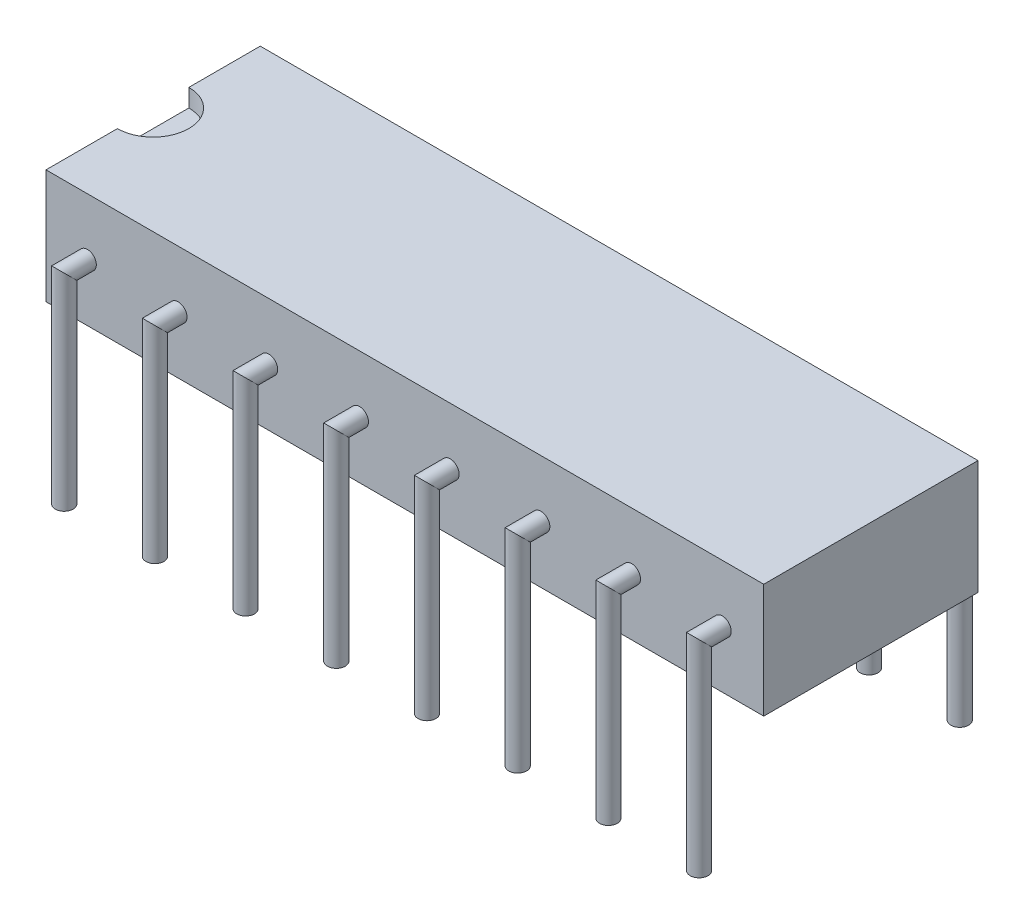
from build123d import *

# Parameters (mm, degrees)
ESQUISSE1_W                          = 6
ESQUISSE1_H                          = 3.2
EXTRUSION1_DEPTH                     = 20.1
ENL_V_MAT_EXTRU_1_DEPTH              = 0.5
ESQUISSE3_R                          = 0.25
R_P_TITION_LIN_AIRE1_COUNT           = 8
R_P_TITION_LIN_AIRE1_PITCH           = 2.54
R_P_TITION_LIN_AIRE1_COPY_1_SKETCH_R = 0.25
R_P_TITION_LIN_AIRE1_COPY_2_SKETCH_R = 0.25
R_P_TITION_LIN_AIRE1_COPY_3_SKETCH_R = 0.25
R_P_TITION_LIN_AIRE1_COPY_4_SKETCH_R = 0.25
R_P_TITION_LIN_AIRE1_COPY_5_SKETCH_R = 0.25
R_P_TITION_LIN_AIRE1_COPY_6_SKETCH_R = 0.25
R_P_TITION_LIN_AIRE1_COPY_7_SKETCH_R = 0.25


with BuildPart() as part:
    # Esquisse1 → Extrusion1 (new body)
    with BuildSketch(Plane(origin=(0, 0, 0), x_dir=(0, 0, -1), z_dir=(1, 0, 0))):
        with Locations((0, 1.6)):
            Rectangle(ESQUISSE1_W, ESQUISSE1_H)
    extrude(amount=EXTRUSION1_DEPTH)

    # Esquisse2 → Enl_v. mat.-Extru.1 (cut)
    with BuildSketch(Plane(origin=(0, 3.2, 0), x_dir=(-1, 0, 0), z_dir=(0, 1, 0))):
        with BuildLine():
            Line((0, -1), (0, 1))
            ThreePointArc((0, 1), (-1, 0), (0, -1))
        make_face()
    extrude(amount=-ENL_V_MAT_EXTRU_1_DEPTH, mode=Mode.SUBTRACT)

    # Balayage1: sweep along a path in Esquisse5
    with BuildLine(Plane(origin=(1.16, 0, 0), x_dir=(0, 0, -1), z_dir=(1, 0, 0))) as balayage1_path:
        Line((-3, 1.6), (-3.65, 1.6))
        Line((-3.65, 1.6), (-3.65, -4))
    # Esquisse3 → Balayage1 (sweep)
    with BuildSketch(Plane.XY.offset(3)):
        with Locations((1.16, 1.6)):
            Circle(ESQUISSE3_R)
    balayage1 = sweep(path=balayage1_path.line, transition=Transition.RIGHT)

    # Sym_trie1: Balayage1 across plane
    add(balayage1.mirror(Plane.XY))

    # R_p_tition lin_aire1: Balayage1 ×8
    with Locations(*[(i * R_P_TITION_LIN_AIRE1_PITCH, 0, 0) for i in range(1, R_P_TITION_LIN_AIRE1_COUNT)]):
        add(balayage1)

    # R_p_tition lin_aire1 copy 1: sweep along a path in R_p_tition lin_aire1 copy 1 path
    with BuildLine(Plane(origin=(3.7, 0, 0), x_dir=(0, 0, 1), z_dir=(1, 0, 0))) as r_p_tition_lin_aire1_copy_1_path:
        Line((-3, -1.6), (-3.65, -1.6))
        Line((-3.65, -1.6), (-3.65, 4))
    # R_p_tition lin_aire1 copy 1 sketch → R_p_tition lin_aire1 copy 1 (sweep)
    with BuildSketch(Plane(origin=(2.54, 0, -3), x_dir=(1, 0, 0), z_dir=(0, 0, -1))):
        with Locations((1.16, -1.6)):
            Circle(R_P_TITION_LIN_AIRE1_COPY_1_SKETCH_R)
    sweep(path=r_p_tition_lin_aire1_copy_1_path.line, transition=Transition.RIGHT)

    # R_p_tition lin_aire1 copy 2: sweep along a path in R_p_tition lin_aire1 copy 2 path
    with BuildLine(Plane(origin=(6.24, 0, 0), x_dir=(0, 0, 1), z_dir=(1, 0, 0))) as r_p_tition_lin_aire1_copy_2_path:
        Line((-3, -1.6), (-3.65, -1.6))
        Line((-3.65, -1.6), (-3.65, 4))
    # R_p_tition lin_aire1 copy 2 sketch → R_p_tition lin_aire1 copy 2 (sweep)
    with BuildSketch(Plane(origin=(5.08, 0, -3), x_dir=(1, 0, 0), z_dir=(0, 0, -1))):
        with Locations((1.16, -1.6)):
            Circle(R_P_TITION_LIN_AIRE1_COPY_2_SKETCH_R)
    sweep(path=r_p_tition_lin_aire1_copy_2_path.line, transition=Transition.RIGHT)

    # R_p_tition lin_aire1 copy 3: sweep along a path in R_p_tition lin_aire1 copy 3 path
    with BuildLine(Plane(origin=(8.78, 0, 0), x_dir=(0, 0, 1), z_dir=(1, 0, 0))) as r_p_tition_lin_aire1_copy_3_path:
        Line((-3, -1.6), (-3.65, -1.6))
        Line((-3.65, -1.6), (-3.65, 4))
    # R_p_tition lin_aire1 copy 3 sketch → R_p_tition lin_aire1 copy 3 (sweep)
    with BuildSketch(Plane(origin=(7.62, 0, -3), x_dir=(1, 0, 0), z_dir=(0, 0, -1))):
        with Locations((1.16, -1.6)):
            Circle(R_P_TITION_LIN_AIRE1_COPY_3_SKETCH_R)
    sweep(path=r_p_tition_lin_aire1_copy_3_path.line, transition=Transition.RIGHT)

    # R_p_tition lin_aire1 copy 4: sweep along a path in R_p_tition lin_aire1 copy 4 path
    with BuildLine(Plane(origin=(11.32, 0, 0), x_dir=(0, 0, 1), z_dir=(1, 0, 0))) as r_p_tition_lin_aire1_copy_4_path:
        Line((-3, -1.6), (-3.65, -1.6))
        Line((-3.65, -1.6), (-3.65, 4))
    # R_p_tition lin_aire1 copy 4 sketch → R_p_tition lin_aire1 copy 4 (sweep)
    with BuildSketch(Plane(origin=(10.16, 0, -3), x_dir=(1, 0, 0), z_dir=(0, 0, -1))):
        with Locations((1.16, -1.6)):
            Circle(R_P_TITION_LIN_AIRE1_COPY_4_SKETCH_R)
    sweep(path=r_p_tition_lin_aire1_copy_4_path.line, transition=Transition.RIGHT)

    # R_p_tition lin_aire1 copy 5: sweep along a path in R_p_tition lin_aire1 copy 5 path
    with BuildLine(Plane(origin=(13.86, 0, 0), x_dir=(0, 0, 1), z_dir=(1, 0, 0))) as r_p_tition_lin_aire1_copy_5_path:
        Line((-3, -1.6), (-3.65, -1.6))
        Line((-3.65, -1.6), (-3.65, 4))
    # R_p_tition lin_aire1 copy 5 sketch → R_p_tition lin_aire1 copy 5 (sweep)
    with BuildSketch(Plane(origin=(12.7, 0, -3), x_dir=(1, 0, 0), z_dir=(0, 0, -1))):
        with Locations((1.16, -1.6)):
            Circle(R_P_TITION_LIN_AIRE1_COPY_5_SKETCH_R)
    sweep(path=r_p_tition_lin_aire1_copy_5_path.line, transition=Transition.RIGHT)

    # R_p_tition lin_aire1 copy 6: sweep along a path in R_p_tition lin_aire1 copy 6 path
    with BuildLine(Plane(origin=(16.4, 0, 0), x_dir=(0, 0, 1), z_dir=(1, 0, 0))) as r_p_tition_lin_aire1_copy_6_path:
        Line((-3, -1.6), (-3.65, -1.6))
        Line((-3.65, -1.6), (-3.65, 4))
    # R_p_tition lin_aire1 copy 6 sketch → R_p_tition lin_aire1 copy 6 (sweep)
    with BuildSketch(Plane(origin=(15.24, 0, -3), x_dir=(1, 0, 0), z_dir=(0, 0, -1))):
        with Locations((1.16, -1.6)):
            Circle(R_P_TITION_LIN_AIRE1_COPY_6_SKETCH_R)
    sweep(path=r_p_tition_lin_aire1_copy_6_path.line, transition=Transition.RIGHT)

    # R_p_tition lin_aire1 copy 7: sweep along a path in R_p_tition lin_aire1 copy 7 path
    with BuildLine(Plane(origin=(18.94, 0, 0), x_dir=(0, 0, 1), z_dir=(1, 0, 0))) as r_p_tition_lin_aire1_copy_7_path:
        Line((-3, -1.6), (-3.65, -1.6))
        Line((-3.65, -1.6), (-3.65, 4))
    # R_p_tition lin_aire1 copy 7 sketch → R_p_tition lin_aire1 copy 7 (sweep)
    with BuildSketch(Plane(origin=(17.78, 0, -3), x_dir=(1, 0, 0), z_dir=(0, 0, -1))):
        with Locations((1.16, -1.6)):
            Circle(R_P_TITION_LIN_AIRE1_COPY_7_SKETCH_R)
    sweep(path=r_p_tition_lin_aire1_copy_7_path.line, transition=Transition.RIGHT)


solid = part.part
